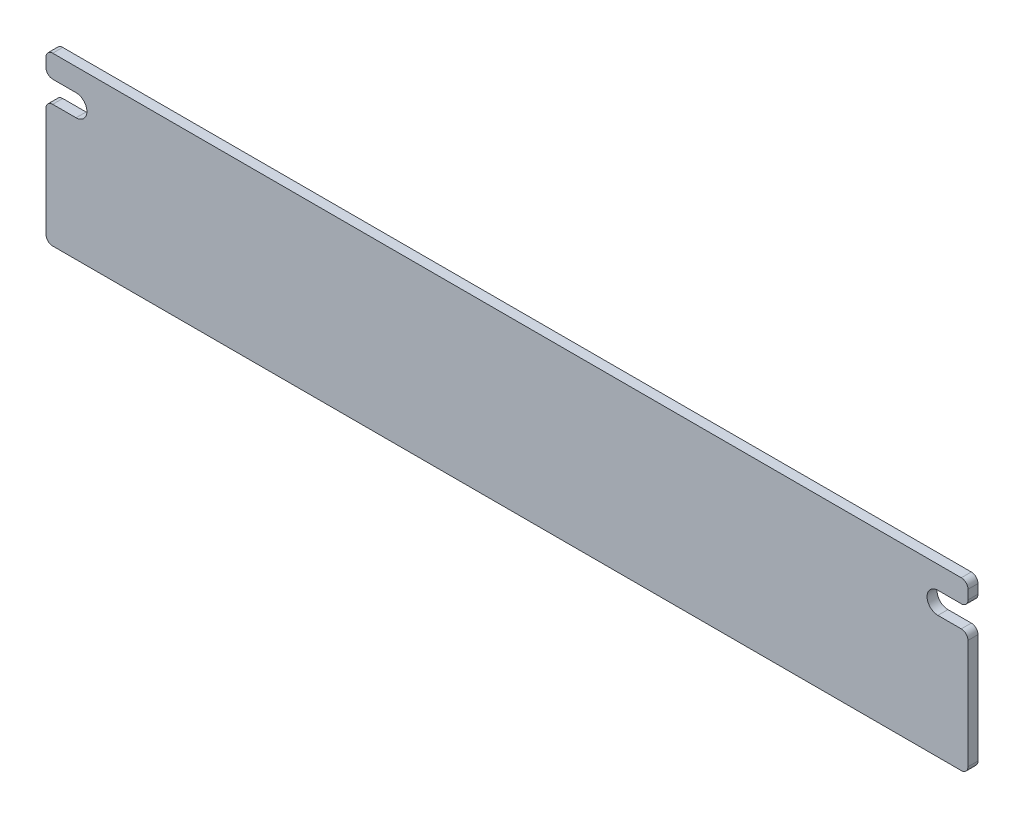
from build123d import *

# Parameters (mm, degrees)
BASE_EXTRUSION_DEPTH = 3
CONG_1_R             = 2


with BuildPart() as part:
    # Esquisse1 → Base-Extrusion (new body)
    with BuildSketch(Plane.XY):
        with BuildLine():
            Line((-138, 25), (138, 25))
            Line((138, 25), (138, 18.25))
            Line((138, 18.25), (129, 18.25))
            ThreePointArc((129, 18.25), (125.75, 15), (129, 11.75))
            Line((129, 11.75), (138, 11.75))
            Line((138, 11.75), (138, -25))
            Line((138, -25), (-138, -25))
            Line((-138, -25), (-138, 11.75))
            Line((-138, 11.75), (-129, 11.75))
            ThreePointArc((-129, 11.75), (-125.75, 15), (-129, 18.25))
            Line((-129, 18.25), (-138, 18.25))
            Line((-138, 18.25), (-138, 25))
        make_face()
    extrude(amount=BASE_EXTRUSION_DEPTH)

    # Cong_1
    cong_1_edges = [part.edges().sort_by_distance(p)[0] for p in [
        (138, -25, 1.5),
        (-138, -25, 1.5),
        (-138, 11.75, 1.5),
        (-138, 18.25, 1.5),
        (-138, 25, 1.5),
        (138, 25, 1.5),
        (138, 18.25, 1.5),
        (138, 11.75, 1.5),
    ]]
    fillet(cong_1_edges, radius=CONG_1_R)


solid = part.part
